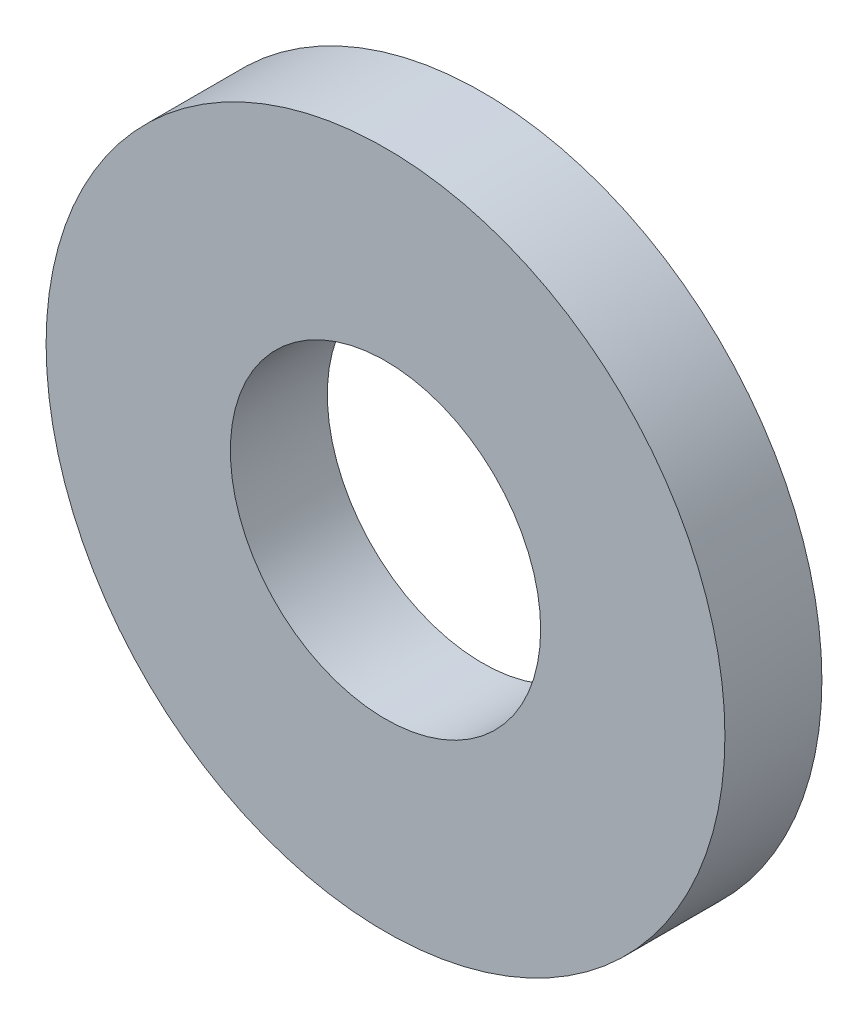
from build123d import *

# Parameters (mm, degrees)
SKETCH1_R           = 3.5
SKETCH1_R_2         = 1.6
BOSS_EXTRUDE1_DEPTH = 1


with BuildPart() as part:
    # Sketch1 → Boss-Extrude1 (new body)
    with BuildSketch(Plane.XY):
        Circle(SKETCH1_R)
        Circle(SKETCH1_R_2, mode=Mode.SUBTRACT)
    extrude(amount=BOSS_EXTRUDE1_DEPTH)


solid = part.part
